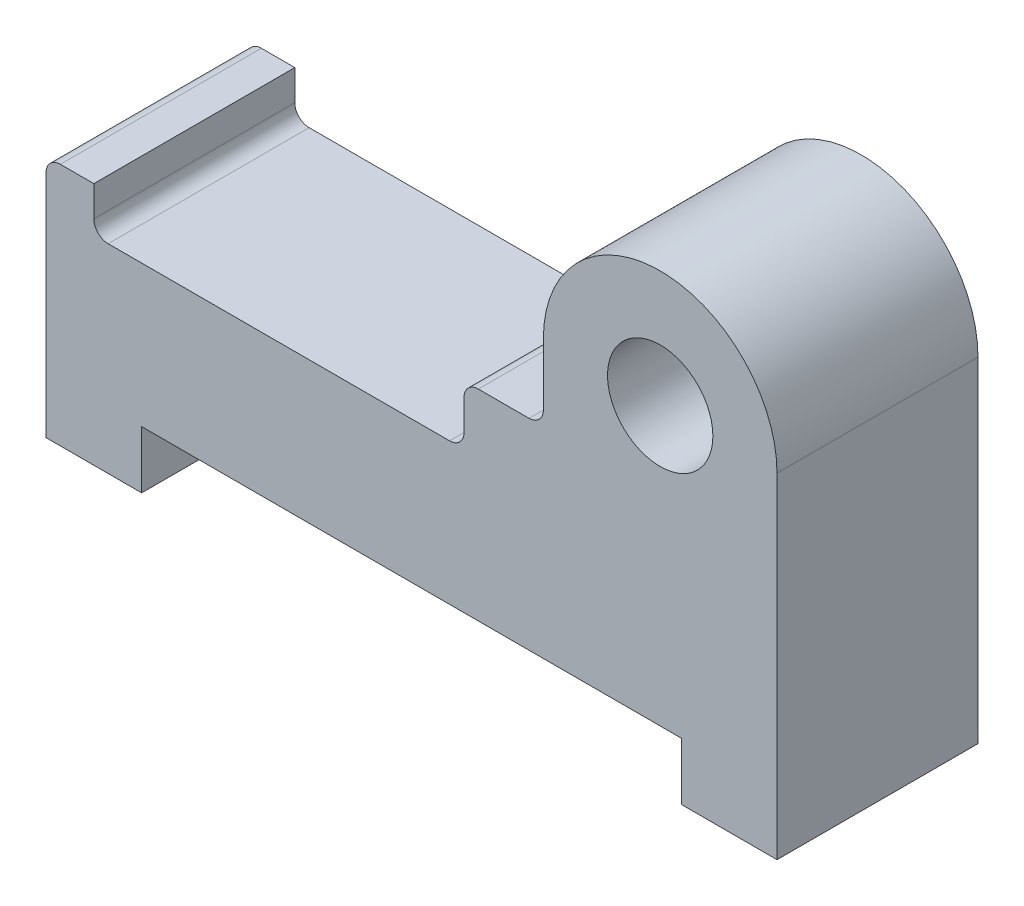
from build123d import *

# Parameters (mm, degrees)
SKETCH1_R      = 11.01372215
EXTRUDE1_DEPTH = 42.025099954


with BuildPart() as part:
    # Sketch1 → Extrude1 (new body)
    with BuildSketch(Plane.XY):
        with BuildLine():
            Line((0, 0), (20, 0))
            Line((20, 0), (20, 12))
            Line((20, 12), (132.850151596, 12))
            Line((132.850151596, 12), (132.850151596, 0))
            Line((132.850151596, 0), (152.850151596, 0))
            Line((152.850151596, 0), (152.850151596, 70))
            ThreePointArc((152.850151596, 70), (128.425075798, 94.425075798), (104, 70))
            Line((104, 70), (104, 57))
            ThreePointArc((104, 57), (103.121320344, 54.878679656), (101, 54))
            Line((101, 54), (90.399498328, 54))
            ThreePointArc((90.399498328, 54), (88.278177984, 53.121320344), (87.399498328, 51))
            Line((87.399498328, 51), (87.399498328, 44.617454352))
            ThreePointArc((87.399498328, 44.617454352), (86.520818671, 42.496134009), (84.399498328, 41.617454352))
            Line((84.399498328, 41.617454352), (13, 41.617454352))
            ThreePointArc((13, 41.617454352), (10.878679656, 42.496134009), (10, 44.617454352))
            Line((10, 44.617454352), (10, 51))
            Line((10, 51), (3, 51))
            ThreePointArc((3, 51), (0.878679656, 50.121320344), (0, 48))
            Line((0, 48), (0, 0))
        make_face()
        with Locations((128.425075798, 70)):
            Circle(SKETCH1_R, mode=Mode.SUBTRACT)
    extrude(amount=EXTRUDE1_DEPTH)


solid = part.part
